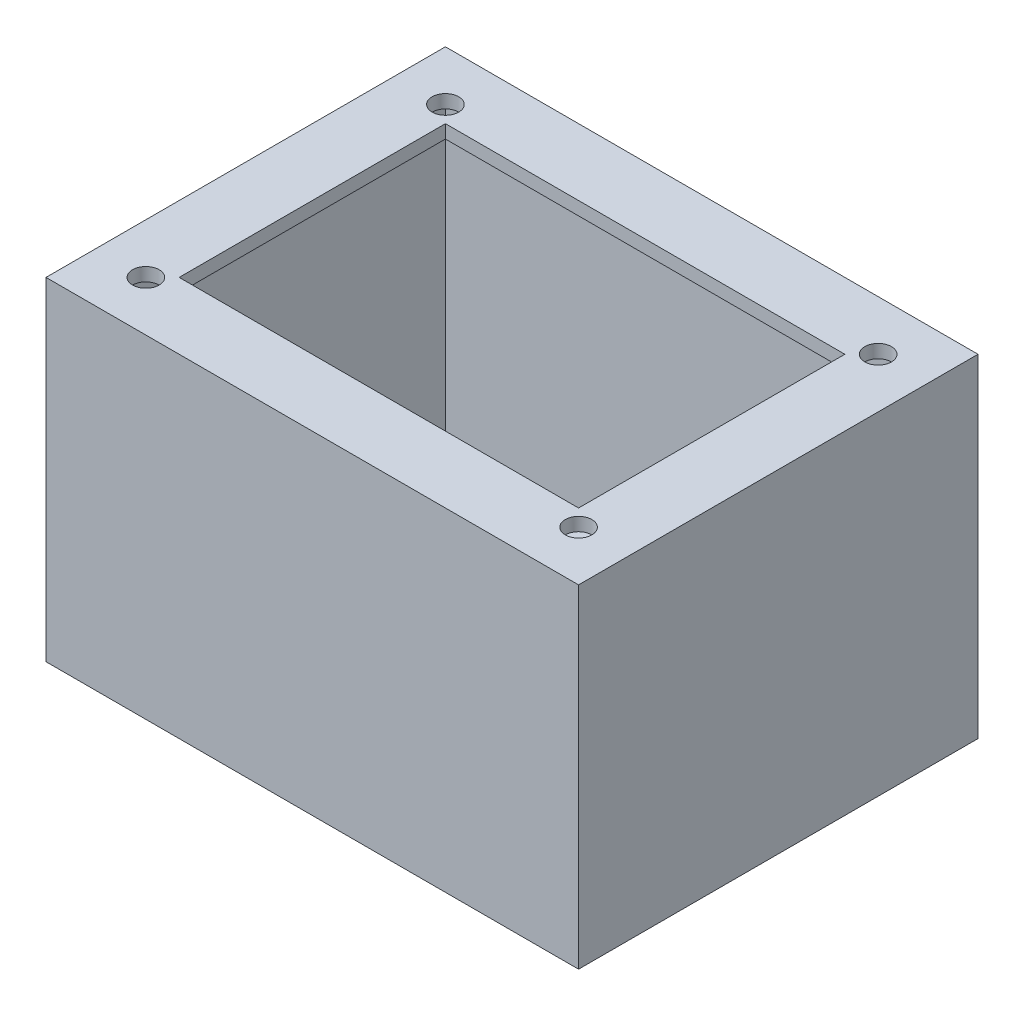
ISO-10303-21;
HEADER;
FILE_DESCRIPTION(('STEP AP214'),'2;1');
FILE_NAME('part.step','',(''),(''),'','','');
FILE_SCHEMA(('AUTOMOTIVE_DESIGN { 1 0 10303 214 1 1 1 1 }'));
ENDSEC;
DATA;
#1=APPLICATION_CONTEXT('core data for automotive mechanical design processes');
#2=APPLICATION_PROTOCOL_DEFINITION('international standard','automotive_design',2000,#1);
#3=PRODUCT_CONTEXT('',#1,'mechanical');
#4=PRODUCT('Part','Part','',(#3));
#5=PRODUCT_RELATED_PRODUCT_CATEGORY('part','',(#4));
#6=PRODUCT_DEFINITION_FORMATION('','',#4);
#7=PRODUCT_DEFINITION_CONTEXT('part definition',#1,'design');
#8=PRODUCT_DEFINITION('design','',#6,#7);
#9=PRODUCT_DEFINITION_SHAPE('','',#8);
#10=(LENGTH_UNIT() NAMED_UNIT(*) SI_UNIT(.MILLI.,.METRE.));
#11=(NAMED_UNIT(*) PLANE_ANGLE_UNIT() SI_UNIT($,.RADIAN.));
#12=(NAMED_UNIT(*) SI_UNIT($,.STERADIAN.) SOLID_ANGLE_UNIT());
#13=UNCERTAINTY_MEASURE_WITH_UNIT(LENGTH_MEASURE(1.E-05),#10,'distance_accuracy_value','');
#14=(GEOMETRIC_REPRESENTATION_CONTEXT(3) GLOBAL_UNCERTAINTY_ASSIGNED_CONTEXT((#13)) GLOBAL_UNIT_ASSIGNED_CONTEXT((#10,
#11,#12)) REPRESENTATION_CONTEXT('',''));
#15=CARTESIAN_POINT('',(0.,0.,0.));
#16=DIRECTION('',(0.,0.,1.));
#17=DIRECTION('',(1.,0.,0.));
#18=AXIS2_PLACEMENT_3D('',#15,#16,#17);
#19=CARTESIAN_POINT('',(-50.8,63.5,-38.1));
#20=DIRECTION('',(0.,1.,0.));
#21=DIRECTION('',(0.,0.,1.));
#22=AXIS2_PLACEMENT_3D('',#19,#20,#21);
#23=PLANE('',#22);
#24=CARTESIAN_POINT('',(-41.275,63.5,28.575));
#25=DIRECTION('',(0.,-1.,0.));
#26=DIRECTION('',(0.,0.,-1.));
#27=AXIS2_PLACEMENT_3D('',#24,#25,#26);
#28=CIRCLE('',#27,2.54);
#29=CARTESIAN_POINT('',(-41.275,63.5,26.035));
#30=VERTEX_POINT('',#29);
#31=EDGE_CURVE('E319',#30,#30,#28,.T.);
#32=ORIENTED_EDGE('',*,*,#31,.T.);
#33=EDGE_LOOP('',(#32));
#34=FACE_BOUND('',#33,.T.);
#35=CARTESIAN_POINT('',(-41.275,63.5,-28.575));
#36=DIRECTION('',(0.,1.,0.));
#37=DIRECTION('',(0.,0.,1.));
#38=AXIS2_PLACEMENT_3D('',#35,#36,#37);
#39=CIRCLE('',#38,2.54);
#40=CARTESIAN_POINT('',(-41.275,63.5,-26.035));
#41=VERTEX_POINT('',#40);
#42=EDGE_CURVE('E324',#41,#41,#39,.T.);
#43=ORIENTED_EDGE('',*,*,#42,.F.);
#44=EDGE_LOOP('',(#43));
#45=FACE_BOUND('',#44,.T.);
#46=DIRECTION('',(0.,0.,1.));
#47=VECTOR('',#46,1.);
#48=CARTESIAN_POINT('',(-50.8,63.5,38.1));
#49=LINE('',#48,#47);
#50=CARTESIAN_POINT('',(-50.8,63.5,-38.1));
#51=VERTEX_POINT('',#50);
#52=CARTESIAN_POINT('',(-50.8,63.5,38.1));
#53=VERTEX_POINT('',#52);
#54=EDGE_CURVE('E205',#51,#53,#49,.T.);
#55=ORIENTED_EDGE('',*,*,#54,.T.);
#56=DIRECTION('',(1.,0.,0.));
#57=VECTOR('',#56,1.);
#58=CARTESIAN_POINT('',(50.8,63.5,38.1));
#59=LINE('',#58,#57);
#60=CARTESIAN_POINT('',(50.8,63.5,38.1));
#61=VERTEX_POINT('',#60);
#62=EDGE_CURVE('E84',#53,#61,#59,.T.);
#63=ORIENTED_EDGE('',*,*,#62,.T.);
#64=DIRECTION('',(0.,0.,-1.));
#65=VECTOR('',#64,1.);
#66=CARTESIAN_POINT('',(50.8,63.5,38.1));
#67=LINE('',#66,#65);
#68=CARTESIAN_POINT('',(50.8,63.5,-38.1));
#69=VERTEX_POINT('',#68);
#70=EDGE_CURVE('E208',#61,#69,#67,.T.);
#71=ORIENTED_EDGE('',*,*,#70,.T.);
#72=DIRECTION('',(-1.,0.,0.));
#73=VECTOR('',#72,1.);
#74=CARTESIAN_POINT('',(50.8,63.5,-38.1));
#75=LINE('',#74,#73);
#76=EDGE_CURVE('E56',#69,#51,#75,.T.);
#77=ORIENTED_EDGE('',*,*,#76,.T.);
#78=EDGE_LOOP('',(#55,#63,#71,#77));
#79=FACE_BOUND('',#78,.T.);
#80=DIRECTION('',(-1.,0.,0.));
#81=VECTOR('',#80,1.);
#82=CARTESIAN_POINT('',(38.1,63.5,-25.4));
#83=LINE('',#82,#81);
#84=CARTESIAN_POINT('',(38.1,63.5,-25.4));
#85=VERTEX_POINT('',#84);
#86=CARTESIAN_POINT('',(-38.1,63.5,-25.4));
#87=VERTEX_POINT('',#86);
#88=EDGE_CURVE('E137',#85,#87,#83,.T.);
#89=ORIENTED_EDGE('',*,*,#88,.F.);
#90=DIRECTION('',(0.,0.,-1.));
#91=VECTOR('',#90,1.);
#92=CARTESIAN_POINT('',(38.1,63.5,25.4));
#93=LINE('',#92,#91);
#94=CARTESIAN_POINT('',(38.1,63.5,25.4));
#95=VERTEX_POINT('',#94);
#96=EDGE_CURVE('E154',#95,#85,#93,.T.);
#97=ORIENTED_EDGE('',*,*,#96,.F.);
#98=DIRECTION('',(1.,0.,0.));
#99=VECTOR('',#98,1.);
#100=CARTESIAN_POINT('',(-38.1,63.5,25.4));
#101=LINE('',#100,#99);
#102=CARTESIAN_POINT('',(-38.1,63.5,25.4));
#103=VERTEX_POINT('',#102);
#104=EDGE_CURVE('E157',#103,#95,#101,.T.);
#105=ORIENTED_EDGE('',*,*,#104,.F.);
#106=DIRECTION('',(0.,0.,1.));
#107=VECTOR('',#106,1.);
#108=CARTESIAN_POINT('',(-38.1,63.5,-25.4));
#109=LINE('',#108,#107);
#110=EDGE_CURVE('E166',#87,#103,#109,.T.);
#111=ORIENTED_EDGE('',*,*,#110,.F.);
#112=EDGE_LOOP('',(#89,#97,#105,#111));
#113=FACE_BOUND('',#112,.T.);
#114=CARTESIAN_POINT('',(41.275,63.5,28.575));
#115=DIRECTION('',(0.,1.,0.));
#116=DIRECTION('',(0.,0.,-1.));
#117=AXIS2_PLACEMENT_3D('',#114,#115,#116);
#118=CIRCLE('',#117,2.54);
#119=CARTESIAN_POINT('',(41.275,63.5,26.035));
#120=VERTEX_POINT('',#119);
#121=EDGE_CURVE('E311',#120,#120,#118,.T.);
#122=ORIENTED_EDGE('',*,*,#121,.F.);
#123=EDGE_LOOP('',(#122));
#124=FACE_BOUND('',#123,.T.);
#125=CARTESIAN_POINT('',(41.275,63.5,-28.575));
#126=DIRECTION('',(0.,-1.,0.));
#127=DIRECTION('',(0.,0.,1.));
#128=AXIS2_PLACEMENT_3D('',#125,#126,#127);
#129=CIRCLE('',#128,2.54);
#130=CARTESIAN_POINT('',(41.275,63.5,-26.035));
#131=VERTEX_POINT('',#130);
#132=EDGE_CURVE('E306',#131,#131,#129,.T.);
#133=ORIENTED_EDGE('',*,*,#132,.T.);
#134=EDGE_LOOP('',(#133));
#135=FACE_BOUND('',#134,.T.);
#136=ADVANCED_FACE('F32',(#34,#45,#79,#113,#124,#135),#23,.T.);
#137=CARTESIAN_POINT('',(-44.45,60.96,-31.75));
#138=DIRECTION('',(0.,1.,0.));
#139=DIRECTION('',(0.,0.,1.));
#140=AXIS2_PLACEMENT_3D('',#137,#138,#139);
#141=PLANE('',#140);
#142=CARTESIAN_POINT('',(-41.275,60.96,28.575));
#143=DIRECTION('',(0.,1.,0.));
#144=DIRECTION('',(0.,0.,1.));
#145=AXIS2_PLACEMENT_3D('',#142,#143,#144);
#146=CIRCLE('',#145,2.54);
#147=CARTESIAN_POINT('',(-41.275,60.96,31.115));
#148=VERTEX_POINT('',#147);
#149=EDGE_CURVE('E321',#148,#148,#146,.T.);
#150=ORIENTED_EDGE('',*,*,#149,.T.);
#151=EDGE_LOOP('',(#150));
#152=FACE_BOUND('',#151,.T.);
#153=CARTESIAN_POINT('',(-41.275,60.96,-28.575));
#154=DIRECTION('',(0.,1.,0.));
#155=DIRECTION('',(0.,0.,1.));
#156=AXIS2_PLACEMENT_3D('',#153,#154,#155);
#157=CIRCLE('',#156,2.54);
#158=CARTESIAN_POINT('',(-41.275,60.96,-26.035));
#159=VERTEX_POINT('',#158);
#160=EDGE_CURVE('E160',#159,#159,#157,.F.);
#161=ORIENTED_EDGE('',*,*,#160,.F.);
#162=EDGE_LOOP('',(#161));
#163=FACE_BOUND('',#162,.T.);
#164=DIRECTION('',(0.,0.,-1.));
#165=VECTOR('',#164,1.);
#166=CARTESIAN_POINT('',(38.1,60.96,25.4));
#167=LINE('',#166,#165);
#168=CARTESIAN_POINT('',(38.1,60.96,25.4));
#169=VERTEX_POINT('',#168);
#170=CARTESIAN_POINT('',(38.1,60.96,-25.4));
#171=VERTEX_POINT('',#170);
#172=EDGE_CURVE('E142',#169,#171,#167,.T.);
#173=ORIENTED_EDGE('',*,*,#172,.T.);
#174=DIRECTION('',(-1.,0.,0.));
#175=VECTOR('',#174,1.);
#176=CARTESIAN_POINT('',(38.1,60.96,-25.4));
#177=LINE('',#176,#175);
#178=CARTESIAN_POINT('',(-38.1,60.96,-25.4));
#179=VERTEX_POINT('',#178);
#180=EDGE_CURVE('E134',#171,#179,#177,.T.);
#181=ORIENTED_EDGE('',*,*,#180,.T.);
#182=DIRECTION('',(0.,0.,1.));
#183=VECTOR('',#182,1.);
#184=CARTESIAN_POINT('',(-38.1,60.96,-25.4));
#185=LINE('',#184,#183);
#186=CARTESIAN_POINT('',(-38.1,60.96,25.4));
#187=VERTEX_POINT('',#186);
#188=EDGE_CURVE('E146',#179,#187,#185,.T.);
#189=ORIENTED_EDGE('',*,*,#188,.T.);
#190=DIRECTION('',(1.,0.,0.));
#191=VECTOR('',#190,1.);
#192=CARTESIAN_POINT('',(-38.1,60.96,25.4));
#193=LINE('',#192,#191);
#194=EDGE_CURVE('E150',#187,#169,#193,.T.);
#195=ORIENTED_EDGE('',*,*,#194,.T.);
#196=EDGE_LOOP('',(#173,#181,#189,#195));
#197=FACE_BOUND('',#196,.T.);
#198=DIRECTION('',(-1.,0.,0.));
#199=VECTOR('',#198,1.);
#200=CARTESIAN_POINT('',(44.45,60.96,-31.75));
#201=LINE('',#200,#199);
#202=CARTESIAN_POINT('',(44.45,60.96,-31.75));
#203=VERTEX_POINT('',#202);
#204=CARTESIAN_POINT('',(-44.45,60.96,-31.75));
#205=VERTEX_POINT('',#204);
#206=EDGE_CURVE('E172',#203,#205,#201,.T.);
#207=ORIENTED_EDGE('',*,*,#206,.F.);
#208=DIRECTION('',(0.,0.,-1.));
#209=VECTOR('',#208,1.);
#210=CARTESIAN_POINT('',(44.45,60.96,31.75));
#211=LINE('',#210,#209);
#212=CARTESIAN_POINT('',(44.45,60.96,31.75));
#213=VERTEX_POINT('',#212);
#214=EDGE_CURVE('E181',#213,#203,#211,.T.);
#215=ORIENTED_EDGE('',*,*,#214,.F.);
#216=DIRECTION('',(1.,0.,0.));
#217=VECTOR('',#216,1.);
#218=CARTESIAN_POINT('',(-44.45,60.96,31.75));
#219=LINE('',#218,#217);
#220=CARTESIAN_POINT('',(-44.45,60.96,31.75));
#221=VERTEX_POINT('',#220);
#222=EDGE_CURVE('E178',#221,#213,#219,.T.);
#223=ORIENTED_EDGE('',*,*,#222,.F.);
#224=DIRECTION('',(0.,0.,1.));
#225=VECTOR('',#224,1.);
#226=CARTESIAN_POINT('',(-44.45,60.96,-31.75));
#227=LINE('',#226,#225);
#228=EDGE_CURVE('E47',#205,#221,#227,.T.);
#229=ORIENTED_EDGE('',*,*,#228,.F.);
#230=EDGE_LOOP('',(#207,#215,#223,#229));
#231=FACE_BOUND('',#230,.T.);
#232=CARTESIAN_POINT('',(41.275,60.96,28.575));
#233=DIRECTION('',(0.,1.,0.));
#234=DIRECTION('',(0.,0.,1.));
#235=AXIS2_PLACEMENT_3D('',#232,#233,#234);
#236=CIRCLE('',#235,2.54);
#237=CARTESIAN_POINT('',(41.275,60.96,31.115));
#238=VERTEX_POINT('',#237);
#239=EDGE_CURVE('E314',#238,#238,#236,.F.);
#240=ORIENTED_EDGE('',*,*,#239,.F.);
#241=EDGE_LOOP('',(#240));
#242=FACE_BOUND('',#241,.T.);
#243=CARTESIAN_POINT('',(41.275,60.96,-28.575));
#244=DIRECTION('',(0.,1.,0.));
#245=DIRECTION('',(0.,0.,1.));
#246=AXIS2_PLACEMENT_3D('',#243,#244,#245);
#247=CIRCLE('',#246,2.54);
#248=CARTESIAN_POINT('',(41.275,60.96,-26.035));
#249=VERTEX_POINT('',#248);
#250=EDGE_CURVE('E309',#249,#249,#247,.T.);
#251=ORIENTED_EDGE('',*,*,#250,.T.);
#252=EDGE_LOOP('',(#251));
#253=FACE_BOUND('',#252,.T.);
#254=ADVANCED_FACE('F152',(#152,#163,#197,#231,#242,#253),#141,.F.);
#255=CARTESIAN_POINT('',(-50.8,63.5,38.1));
#256=DIRECTION('',(1.,0.,0.));
#257=DIRECTION('',(0.,0.,-1.));
#258=AXIS2_PLACEMENT_3D('',#255,#256,#257);
#259=PLANE('',#258);
#260=DIRECTION('',(0.,0.,1.));
#261=VECTOR('',#260,1.);
#262=CARTESIAN_POINT('',(-50.8,0.,38.1));
#263=LINE('',#262,#261);
#264=CARTESIAN_POINT('',(-50.8,0.,-38.1));
#265=VERTEX_POINT('',#264);
#266=CARTESIAN_POINT('',(-50.8,0.,38.1));
#267=VERTEX_POINT('',#266);
#268=EDGE_CURVE('E190',#265,#267,#263,.T.);
#269=ORIENTED_EDGE('',*,*,#268,.T.);
#270=DIRECTION('',(0.,-1.,0.));
#271=VECTOR('',#270,1.);
#272=CARTESIAN_POINT('',(-50.8,63.5,38.1));
#273=LINE('',#272,#271);
#274=EDGE_CURVE('E11',#53,#267,#273,.T.);
#275=ORIENTED_EDGE('',*,*,#274,.F.);
#276=ORIENTED_EDGE('',*,*,#54,.F.);
#277=DIRECTION('',(0.,-1.,0.));
#278=VECTOR('',#277,1.);
#279=CARTESIAN_POINT('',(-50.8,63.5,-38.1));
#280=LINE('',#279,#278);
#281=EDGE_CURVE('E211',#51,#265,#280,.T.);
#282=ORIENTED_EDGE('',*,*,#281,.T.);
#283=EDGE_LOOP('',(#269,#275,#276,#282));
#284=FACE_BOUND('',#283,.T.);
#285=ADVANCED_FACE('F34',(#284),#259,.F.);
#286=CARTESIAN_POINT('',(50.8,63.5,38.1));
#287=DIRECTION('',(0.,0.,-1.));
#288=DIRECTION('',(-1.,0.,0.));
#289=AXIS2_PLACEMENT_3D('',#286,#287,#288);
#290=PLANE('',#289);
#291=DIRECTION('',(1.,0.,0.));
#292=VECTOR('',#291,1.);
#293=CARTESIAN_POINT('',(50.8,0.,38.1));
#294=LINE('',#293,#292);
#295=CARTESIAN_POINT('',(50.8,0.,38.1));
#296=VERTEX_POINT('',#295);
#297=EDGE_CURVE('E214',#267,#296,#294,.T.);
#298=ORIENTED_EDGE('',*,*,#297,.T.);
#299=DIRECTION('',(0.,-1.,0.));
#300=VECTOR('',#299,1.);
#301=CARTESIAN_POINT('',(50.8,63.5,38.1));
#302=LINE('',#301,#300);
#303=EDGE_CURVE('E40',#61,#296,#302,.T.);
#304=ORIENTED_EDGE('',*,*,#303,.F.);
#305=ORIENTED_EDGE('',*,*,#62,.F.);
#306=ORIENTED_EDGE('',*,*,#274,.T.);
#307=EDGE_LOOP('',(#298,#304,#305,#306));
#308=FACE_BOUND('',#307,.T.);
#309=ADVANCED_FACE('F241',(#308),#290,.F.);
#310=CARTESIAN_POINT('',(50.8,63.5,38.1));
#311=DIRECTION('',(-1.,0.,0.));
#312=DIRECTION('',(0.,0.,1.));
#313=AXIS2_PLACEMENT_3D('',#310,#311,#312);
#314=PLANE('',#313);
#315=DIRECTION('',(0.,0.,-1.));
#316=VECTOR('',#315,1.);
#317=CARTESIAN_POINT('',(50.8,0.,38.1));
#318=LINE('',#317,#316);
#319=CARTESIAN_POINT('',(50.8,0.,-38.1));
#320=VERTEX_POINT('',#319);
#321=EDGE_CURVE('E216',#296,#320,#318,.T.);
#322=ORIENTED_EDGE('',*,*,#321,.T.);
#323=DIRECTION('',(0.,-1.,0.));
#324=VECTOR('',#323,1.);
#325=CARTESIAN_POINT('',(50.8,63.5,-38.1));
#326=LINE('',#325,#324);
#327=EDGE_CURVE('E220',#69,#320,#326,.T.);
#328=ORIENTED_EDGE('',*,*,#327,.F.);
#329=ORIENTED_EDGE('',*,*,#70,.F.);
#330=ORIENTED_EDGE('',*,*,#303,.T.);
#331=EDGE_LOOP('',(#322,#328,#329,#330));
#332=FACE_BOUND('',#331,.T.);
#333=ADVANCED_FACE('F225',(#332),#314,.F.);
#334=CARTESIAN_POINT('',(50.8,63.5,-38.1));
#335=DIRECTION('',(0.,0.,1.));
#336=DIRECTION('',(1.,0.,0.));
#337=AXIS2_PLACEMENT_3D('',#334,#335,#336);
#338=PLANE('',#337);
#339=DIRECTION('',(-1.,0.,0.));
#340=VECTOR('',#339,1.);
#341=CARTESIAN_POINT('',(50.8,0.,-38.1));
#342=LINE('',#341,#340);
#343=EDGE_CURVE('E77',#320,#265,#342,.T.);
#344=ORIENTED_EDGE('',*,*,#343,.T.);
#345=ORIENTED_EDGE('',*,*,#281,.F.);
#346=ORIENTED_EDGE('',*,*,#76,.F.);
#347=ORIENTED_EDGE('',*,*,#327,.T.);
#348=EDGE_LOOP('',(#344,#345,#346,#347));
#349=FACE_BOUND('',#348,.T.);
#350=ADVANCED_FACE('F233',(#349),#338,.F.);
#351=CARTESIAN_POINT('',(-50.8,0.,-38.1));
#352=DIRECTION('',(0.,1.,0.));
#353=DIRECTION('',(0.,0.,1.));
#354=AXIS2_PLACEMENT_3D('',#351,#352,#353);
#355=PLANE('',#354);
#356=ORIENTED_EDGE('',*,*,#268,.F.);
#357=ORIENTED_EDGE('',*,*,#343,.F.);
#358=ORIENTED_EDGE('',*,*,#321,.F.);
#359=ORIENTED_EDGE('',*,*,#297,.F.);
#360=EDGE_LOOP('',(#356,#357,#358,#359));
#361=FACE_BOUND('',#360,.T.);
#362=ADVANCED_FACE('F229',(#361),#355,.F.);
#363=CARTESIAN_POINT('',(38.1,60.96,-25.4));
#364=DIRECTION('',(0.,0.,-1.));
#365=DIRECTION('',(-1.,0.,0.));
#366=AXIS2_PLACEMENT_3D('',#363,#364,#365);
#367=PLANE('',#366);
#368=ORIENTED_EDGE('',*,*,#88,.T.);
#369=DIRECTION('',(0.,1.,0.));
#370=VECTOR('',#369,1.);
#371=CARTESIAN_POINT('',(-38.1,60.96,-25.4));
#372=LINE('',#371,#370);
#373=EDGE_CURVE('E130',#179,#87,#372,.T.);
#374=ORIENTED_EDGE('',*,*,#373,.F.);
#375=ORIENTED_EDGE('',*,*,#180,.F.);
#376=DIRECTION('',(0.,1.,0.));
#377=VECTOR('',#376,1.);
#378=CARTESIAN_POINT('',(38.1,60.96,-25.4));
#379=LINE('',#378,#377);
#380=EDGE_CURVE('E170',#171,#85,#379,.T.);
#381=ORIENTED_EDGE('',*,*,#380,.T.);
#382=EDGE_LOOP('',(#368,#374,#375,#381));
#383=FACE_BOUND('',#382,.T.);
#384=ADVANCED_FACE('F132',(#383),#367,.F.);
#385=CARTESIAN_POINT('',(38.1,60.96,25.4));
#386=DIRECTION('',(1.,0.,0.));
#387=DIRECTION('',(0.,0.,-1.));
#388=AXIS2_PLACEMENT_3D('',#385,#386,#387);
#389=PLANE('',#388);
#390=ORIENTED_EDGE('',*,*,#96,.T.);
#391=ORIENTED_EDGE('',*,*,#380,.F.);
#392=ORIENTED_EDGE('',*,*,#172,.F.);
#393=DIRECTION('',(0.,1.,0.));
#394=VECTOR('',#393,1.);
#395=CARTESIAN_POINT('',(38.1,60.96,25.4));
#396=LINE('',#395,#394);
#397=EDGE_CURVE('E173',#169,#95,#396,.T.);
#398=ORIENTED_EDGE('',*,*,#397,.T.);
#399=EDGE_LOOP('',(#390,#391,#392,#398));
#400=FACE_BOUND('',#399,.T.);
#401=ADVANCED_FACE('F277',(#400),#389,.F.);
#402=CARTESIAN_POINT('',(-38.1,60.96,25.4));
#403=DIRECTION('',(0.,0.,1.));
#404=DIRECTION('',(1.,0.,0.));
#405=AXIS2_PLACEMENT_3D('',#402,#403,#404);
#406=PLANE('',#405);
#407=ORIENTED_EDGE('',*,*,#104,.T.);
#408=ORIENTED_EDGE('',*,*,#397,.F.);
#409=ORIENTED_EDGE('',*,*,#194,.F.);
#410=DIRECTION('',(0.,1.,0.));
#411=VECTOR('',#410,1.);
#412=CARTESIAN_POINT('',(-38.1,60.96,25.4));
#413=LINE('',#412,#411);
#414=EDGE_CURVE('E141',#187,#103,#413,.T.);
#415=ORIENTED_EDGE('',*,*,#414,.T.);
#416=EDGE_LOOP('',(#407,#408,#409,#415));
#417=FACE_BOUND('',#416,.T.);
#418=ADVANCED_FACE('F280',(#417),#406,.F.);
#419=CARTESIAN_POINT('',(-38.1,60.96,-25.4));
#420=DIRECTION('',(-1.,0.,0.));
#421=DIRECTION('',(0.,0.,1.));
#422=AXIS2_PLACEMENT_3D('',#419,#420,#421);
#423=PLANE('',#422);
#424=ORIENTED_EDGE('',*,*,#110,.T.);
#425=ORIENTED_EDGE('',*,*,#414,.F.);
#426=ORIENTED_EDGE('',*,*,#188,.F.);
#427=ORIENTED_EDGE('',*,*,#373,.T.);
#428=EDGE_LOOP('',(#424,#425,#426,#427));
#429=FACE_BOUND('',#428,.T.);
#430=ADVANCED_FACE('F147',(#429),#423,.F.);
#431=CARTESIAN_POINT('',(-50.8,6.35,-38.1));
#432=DIRECTION('',(0.,1.,0.));
#433=DIRECTION('',(0.,0.,1.));
#434=AXIS2_PLACEMENT_3D('',#431,#432,#433);
#435=PLANE('',#434);
#436=DIRECTION('',(0.,0.,1.));
#437=VECTOR('',#436,1.);
#438=CARTESIAN_POINT('',(-44.45,6.35,38.1));
#439=LINE('',#438,#437);
#440=CARTESIAN_POINT('',(-44.45,6.35,-31.75));
#441=VERTEX_POINT('',#440);
#442=CARTESIAN_POINT('',(-44.45,6.35,31.75));
#443=VERTEX_POINT('',#442);
#444=EDGE_CURVE('E184',#441,#443,#439,.T.);
#445=ORIENTED_EDGE('',*,*,#444,.T.);
#446=DIRECTION('',(1.,0.,0.));
#447=VECTOR('',#446,1.);
#448=CARTESIAN_POINT('',(50.8,6.35,31.75));
#449=LINE('',#448,#447);
#450=CARTESIAN_POINT('',(44.45,6.35,31.75));
#451=VERTEX_POINT('',#450);
#452=EDGE_CURVE('E187',#443,#451,#449,.T.);
#453=ORIENTED_EDGE('',*,*,#452,.T.);
#454=DIRECTION('',(0.,0.,-1.));
#455=VECTOR('',#454,1.);
#456=CARTESIAN_POINT('',(44.45,6.35,38.1));
#457=LINE('',#456,#455);
#458=CARTESIAN_POINT('',(44.45,6.35,-31.75));
#459=VERTEX_POINT('',#458);
#460=EDGE_CURVE('E198',#451,#459,#457,.T.);
#461=ORIENTED_EDGE('',*,*,#460,.T.);
#462=DIRECTION('',(-1.,0.,0.));
#463=VECTOR('',#462,1.);
#464=CARTESIAN_POINT('',(50.8,6.35,-31.75));
#465=LINE('',#464,#463);
#466=EDGE_CURVE('E195',#459,#441,#465,.T.);
#467=ORIENTED_EDGE('',*,*,#466,.T.);
#468=EDGE_LOOP('',(#445,#453,#461,#467));
#469=FACE_BOUND('',#468,.T.);
#470=ADVANCED_FACE('F254',(#469),#435,.T.);
#471=CARTESIAN_POINT('',(50.8,63.5,-31.75));
#472=DIRECTION('',(0.,0.,1.));
#473=DIRECTION('',(1.,0.,0.));
#474=AXIS2_PLACEMENT_3D('',#471,#472,#473);
#475=PLANE('',#474);
#476=DIRECTION('',(0.,-1.,0.));
#477=VECTOR('',#476,1.);
#478=CARTESIAN_POINT('',(44.45,63.5,-31.75));
#479=LINE('',#478,#477);
#480=EDGE_CURVE('E194',#203,#459,#479,.T.);
#481=ORIENTED_EDGE('',*,*,#480,.F.);
#482=ORIENTED_EDGE('',*,*,#206,.T.);
#483=DIRECTION('',(0.,-1.,0.));
#484=VECTOR('',#483,1.);
#485=CARTESIAN_POINT('',(-44.45,63.5,-31.75));
#486=LINE('',#485,#484);
#487=EDGE_CURVE('E192',#205,#441,#486,.T.);
#488=ORIENTED_EDGE('',*,*,#487,.T.);
#489=ORIENTED_EDGE('',*,*,#466,.F.);
#490=EDGE_LOOP('',(#481,#482,#488,#489));
#491=FACE_BOUND('',#490,.T.);
#492=ADVANCED_FACE('F257',(#491),#475,.T.);
#493=CARTESIAN_POINT('',(44.45,63.5,38.1));
#494=DIRECTION('',(-1.,0.,0.));
#495=DIRECTION('',(0.,0.,1.));
#496=AXIS2_PLACEMENT_3D('',#493,#494,#495);
#497=PLANE('',#496);
#498=DIRECTION('',(0.,-1.,0.));
#499=VECTOR('',#498,1.);
#500=CARTESIAN_POINT('',(44.45,63.5,31.75));
#501=LINE('',#500,#499);
#502=EDGE_CURVE('E191',#213,#451,#501,.T.);
#503=ORIENTED_EDGE('',*,*,#502,.F.);
#504=ORIENTED_EDGE('',*,*,#214,.T.);
#505=ORIENTED_EDGE('',*,*,#480,.T.);
#506=ORIENTED_EDGE('',*,*,#460,.F.);
#507=EDGE_LOOP('',(#503,#504,#505,#506));
#508=FACE_BOUND('',#507,.T.);
#509=ADVANCED_FACE('F261',(#508),#497,.T.);
#510=CARTESIAN_POINT('',(50.8,63.5,31.75));
#511=DIRECTION('',(0.,0.,-1.));
#512=DIRECTION('',(-1.,0.,0.));
#513=AXIS2_PLACEMENT_3D('',#510,#511,#512);
#514=PLANE('',#513);
#515=DIRECTION('',(0.,-1.,0.));
#516=VECTOR('',#515,1.);
#517=CARTESIAN_POINT('',(-44.45,63.5,31.75));
#518=LINE('',#517,#516);
#519=EDGE_CURVE('E188',#221,#443,#518,.T.);
#520=ORIENTED_EDGE('',*,*,#519,.F.);
#521=ORIENTED_EDGE('',*,*,#222,.T.);
#522=ORIENTED_EDGE('',*,*,#502,.T.);
#523=ORIENTED_EDGE('',*,*,#452,.F.);
#524=EDGE_LOOP('',(#520,#521,#522,#523));
#525=FACE_BOUND('',#524,.T.);
#526=ADVANCED_FACE('F265',(#525),#514,.T.);
#527=CARTESIAN_POINT('',(-44.45,63.5,38.1));
#528=DIRECTION('',(1.,0.,0.));
#529=DIRECTION('',(0.,0.,-1.));
#530=AXIS2_PLACEMENT_3D('',#527,#528,#529);
#531=PLANE('',#530);
#532=ORIENTED_EDGE('',*,*,#487,.F.);
#533=ORIENTED_EDGE('',*,*,#228,.T.);
#534=ORIENTED_EDGE('',*,*,#519,.T.);
#535=ORIENTED_EDGE('',*,*,#444,.F.);
#536=EDGE_LOOP('',(#532,#533,#534,#535));
#537=FACE_BOUND('',#536,.T.);
#538=ADVANCED_FACE('F269',(#537),#531,.T.);
#539=CARTESIAN_POINT('',(-41.275,-0.001000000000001,-28.575));
#540=DIRECTION('',(0.,1.,0.));
#541=DIRECTION('',(0.,0.,1.));
#542=AXIS2_PLACEMENT_3D('',#539,#540,#541);
#543=CYLINDRICAL_SURFACE('',#542,2.54);
#544=ORIENTED_EDGE('',*,*,#42,.T.);
#545=EDGE_LOOP('',(#544));
#546=FACE_BOUND('',#545,.T.);
#547=ORIENTED_EDGE('',*,*,#160,.T.);
#548=EDGE_LOOP('',(#547));
#549=FACE_BOUND('',#548,.T.);
#550=ADVANCED_FACE('F272',(#546,#549),#543,.F.);
#551=CARTESIAN_POINT('',(-41.275,-0.001000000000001,28.575));
#552=DIRECTION('',(0.,1.,0.));
#553=DIRECTION('',(0.,0.,1.));
#554=AXIS2_PLACEMENT_3D('',#551,#552,#553);
#555=CYLINDRICAL_SURFACE('',#554,2.54);
#556=ORIENTED_EDGE('',*,*,#31,.F.);
#557=EDGE_LOOP('',(#556));
#558=FACE_BOUND('',#557,.T.);
#559=ORIENTED_EDGE('',*,*,#149,.F.);
#560=EDGE_LOOP('',(#559));
#561=FACE_BOUND('',#560,.T.);
#562=ADVANCED_FACE('F289',(#558,#561),#555,.F.);
#563=CARTESIAN_POINT('',(41.275,-0.001000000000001,28.575));
#564=DIRECTION('',(0.,1.,0.));
#565=DIRECTION('',(0.,0.,1.));
#566=AXIS2_PLACEMENT_3D('',#563,#564,#565);
#567=CYLINDRICAL_SURFACE('',#566,2.54);
#568=ORIENTED_EDGE('',*,*,#121,.T.);
#569=EDGE_LOOP('',(#568));
#570=FACE_BOUND('',#569,.T.);
#571=ORIENTED_EDGE('',*,*,#239,.T.);
#572=EDGE_LOOP('',(#571));
#573=FACE_BOUND('',#572,.T.);
#574=ADVANCED_FACE('F293',(#570,#573),#567,.F.);
#575=CARTESIAN_POINT('',(41.275,-0.001000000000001,-28.575));
#576=DIRECTION('',(0.,1.,0.));
#577=DIRECTION('',(0.,0.,1.));
#578=AXIS2_PLACEMENT_3D('',#575,#576,#577);
#579=CYLINDRICAL_SURFACE('',#578,2.54);
#580=ORIENTED_EDGE('',*,*,#132,.F.);
#581=EDGE_LOOP('',(#580));
#582=FACE_BOUND('',#581,.T.);
#583=ORIENTED_EDGE('',*,*,#250,.F.);
#584=EDGE_LOOP('',(#583));
#585=FACE_BOUND('',#584,.T.);
#586=ADVANCED_FACE('F297',(#582,#585),#579,.F.);
#587=CLOSED_SHELL('',(#136,#254,#285,#309,#333,#350,#362,#384,#401,#418,#430,#470,#492,#509,
#526,#538,#550,#562,#574,#586));
#588=MANIFOLD_SOLID_BREP('B2',#587);
#589=ADVANCED_BREP_SHAPE_REPRESENTATION('',(#18,#588),#14);
#590=SHAPE_DEFINITION_REPRESENTATION(#9,#589);
ENDSEC;
END-ISO-10303-21;
